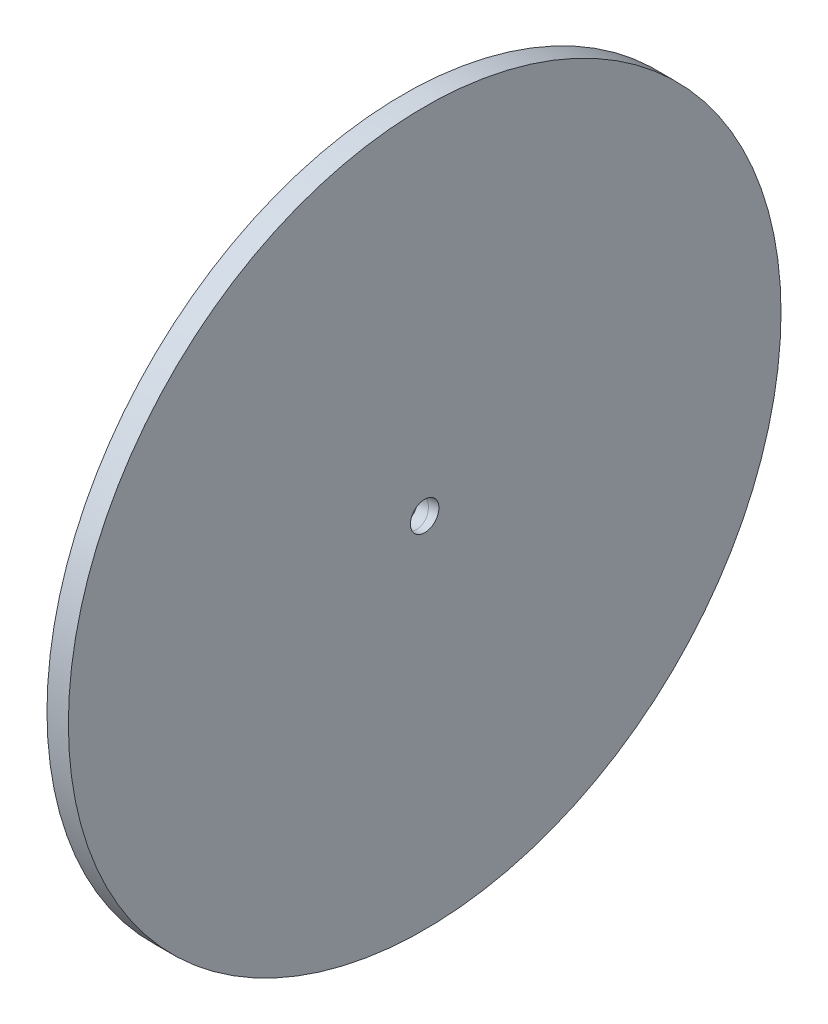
ISO-10303-21;
HEADER;
FILE_DESCRIPTION(('STEP AP214'),'2;1');
FILE_NAME('part.step','',(''),(''),'','','');
FILE_SCHEMA(('AUTOMOTIVE_DESIGN { 1 0 10303 214 1 1 1 1 }'));
ENDSEC;
DATA;
#1=APPLICATION_CONTEXT('core data for automotive mechanical design processes');
#2=APPLICATION_PROTOCOL_DEFINITION('international standard','automotive_design',2000,#1);
#3=PRODUCT_CONTEXT('',#1,'mechanical');
#4=PRODUCT('Part','Part','',(#3));
#5=PRODUCT_RELATED_PRODUCT_CATEGORY('part','',(#4));
#6=PRODUCT_DEFINITION_FORMATION('','',#4);
#7=PRODUCT_DEFINITION_CONTEXT('part definition',#1,'design');
#8=PRODUCT_DEFINITION('design','',#6,#7);
#9=PRODUCT_DEFINITION_SHAPE('','',#8);
#10=(LENGTH_UNIT() NAMED_UNIT(*) SI_UNIT(.MILLI.,.METRE.));
#11=(NAMED_UNIT(*) PLANE_ANGLE_UNIT() SI_UNIT($,.RADIAN.));
#12=(NAMED_UNIT(*) SI_UNIT($,.STERADIAN.) SOLID_ANGLE_UNIT());
#13=UNCERTAINTY_MEASURE_WITH_UNIT(LENGTH_MEASURE(1.E-05),#10,'distance_accuracy_value','');
#14=(GEOMETRIC_REPRESENTATION_CONTEXT(3) GLOBAL_UNCERTAINTY_ASSIGNED_CONTEXT((#13)) GLOBAL_UNIT_ASSIGNED_CONTEXT((#10,
#11,#12)) REPRESENTATION_CONTEXT('',''));
#15=CARTESIAN_POINT('',(0.,0.,0.));
#16=DIRECTION('',(0.,0.,1.));
#17=DIRECTION('',(1.,0.,0.));
#18=AXIS2_PLACEMENT_3D('',#15,#16,#17);
#19=CARTESIAN_POINT('',(3.,0.,0.));
#20=DIRECTION('',(-1.,0.,0.));
#21=DIRECTION('',(0.,0.,1.));
#22=AXIS2_PLACEMENT_3D('',#19,#20,#21);
#23=CYLINDRICAL_SURFACE('',#22,50.);
#24=CARTESIAN_POINT('',(3.,0.,0.));
#25=DIRECTION('',(1.,0.,0.));
#26=DIRECTION('',(0.,0.,-1.));
#27=AXIS2_PLACEMENT_3D('',#24,#25,#26);
#28=CIRCLE('',#27,50.);
#29=CARTESIAN_POINT('',(3.,0.,-50.));
#30=VERTEX_POINT('',#29);
#31=EDGE_CURVE('E11',#30,#30,#28,.T.);
#32=ORIENTED_EDGE('',*,*,#31,.F.);
#33=EDGE_LOOP('',(#32));
#34=FACE_BOUND('',#33,.T.);
#35=CARTESIAN_POINT('',(0.,0.,0.));
#36=DIRECTION('',(1.,0.,0.));
#37=DIRECTION('',(0.,0.,-1.));
#38=AXIS2_PLACEMENT_3D('',#35,#36,#37);
#39=CIRCLE('',#38,50.);
#40=CARTESIAN_POINT('',(0.,0.,-50.));
#41=VERTEX_POINT('',#40);
#42=EDGE_CURVE('E63',#41,#41,#39,.T.);
#43=ORIENTED_EDGE('',*,*,#42,.T.);
#44=EDGE_LOOP('',(#43));
#45=FACE_BOUND('',#44,.T.);
#46=ADVANCED_FACE('F55',(#34,#45),#23,.T.);
#47=CARTESIAN_POINT('',(3.,0.,0.));
#48=DIRECTION('',(1.,0.,0.));
#49=DIRECTION('',(0.,0.,-1.));
#50=AXIS2_PLACEMENT_3D('',#47,#48,#49);
#51=PLANE('',#50);
#52=CARTESIAN_POINT('',(3.,0.264490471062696,0.));
#53=DIRECTION('',(1.,0.,0.));
#54=DIRECTION('',(0.,-1.,0.));
#55=AXIS2_PLACEMENT_3D('',#52,#53,#54);
#56=ELLIPSE('',#55,2.03085322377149,2.);
#57=CARTESIAN_POINT('',(3.,-1.76636275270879,0.));
#58=VERTEX_POINT('',#57);
#59=EDGE_CURVE('E58',#58,#58,#56,.F.);
#60=ORIENTED_EDGE('',*,*,#59,.T.);
#61=EDGE_LOOP('',(#60));
#62=FACE_BOUND('',#61,.T.);
#63=ORIENTED_EDGE('',*,*,#31,.T.);
#64=EDGE_LOOP('',(#63));
#65=FACE_BOUND('',#64,.T.);
#66=ADVANCED_FACE('F96',(#62,#65),#51,.T.);
#67=CARTESIAN_POINT('',(0.,0.,0.));
#68=DIRECTION('',(1.,0.,0.));
#69=DIRECTION('',(0.,0.,-1.));
#70=AXIS2_PLACEMENT_3D('',#67,#68,#69);
#71=PLANE('',#70);
#72=CARTESIAN_POINT('',(0.,-0.264490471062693,0.));
#73=DIRECTION('',(1.,0.,0.));
#74=DIRECTION('',(0.,-1.,0.));
#75=AXIS2_PLACEMENT_3D('',#72,#73,#74);
#76=ELLIPSE('',#75,2.03085322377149,2.);
#77=CARTESIAN_POINT('',(0.,-2.29534369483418,0.));
#78=VERTEX_POINT('',#77);
#79=EDGE_CURVE('E72',#78,#78,#76,.F.);
#80=ORIENTED_EDGE('',*,*,#79,.F.);
#81=EDGE_LOOP('',(#80));
#82=FACE_BOUND('',#81,.T.);
#83=ORIENTED_EDGE('',*,*,#42,.F.);
#84=EDGE_LOOP('',(#83));
#85=FACE_BOUND('',#84,.T.);
#86=ADVANCED_FACE('F92',(#82,#85),#71,.F.);
#87=CARTESIAN_POINT('',(1.5,0.,0.));
#88=DIRECTION('',(-0.984807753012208,-0.173648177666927,0.));
#89=DIRECTION('',(0.173648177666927,-0.984807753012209,0.));
#90=AXIS2_PLACEMENT_3D('',#87,#88,#89);
#91=CYLINDRICAL_SURFACE('',#90,2.);
#92=CARTESIAN_POINT('',(1.5,0.,0.));
#93=DIRECTION('',(0.984807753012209,0.173648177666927,0.));
#94=DIRECTION('',(-0.173648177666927,0.984807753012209,0.));
#95=AXIS2_PLACEMENT_3D('',#92,#93,#94);
#96=CIRCLE('',#95,2.);
#97=CARTESIAN_POINT('',(1.15270364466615,1.96961550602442,0.));
#98=VERTEX_POINT('',#97);
#99=EDGE_CURVE('E71',#98,#98,#96,.T.);
#100=ORIENTED_EDGE('',*,*,#99,.T.);
#101=EDGE_LOOP('',(#100));
#102=FACE_BOUND('',#101,.T.);
#103=ORIENTED_EDGE('',*,*,#79,.T.);
#104=EDGE_LOOP('',(#103));
#105=FACE_BOUND('',#104,.T.);
#106=ADVANCED_FACE('F83',(#102,#105),#91,.F.);
#107=CARTESIAN_POINT('',(29.4430620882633,4.92711576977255,0.));
#108=DIRECTION('',(-0.984807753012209,-0.173648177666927,0.));
#109=DIRECTION('',(0.173648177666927,-0.984807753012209,0.));
#110=AXIS2_PLACEMENT_3D('',#107,#108,#109);
#111=CYLINDRICAL_SURFACE('',#110,2.);
#112=ORIENTED_EDGE('',*,*,#59,.F.);
#113=EDGE_LOOP('',(#112));
#114=FACE_BOUND('',#113,.T.);
#115=ORIENTED_EDGE('',*,*,#99,.F.);
#116=EDGE_LOOP('',(#115));
#117=FACE_BOUND('',#116,.T.);
#118=ADVANCED_FACE('F85',(#114,#117),#111,.F.);
#119=CLOSED_SHELL('',(#46,#66,#86,#106,#118));
#120=MANIFOLD_SOLID_BREP('B2',#119);
#121=ADVANCED_BREP_SHAPE_REPRESENTATION('',(#18,#120),#14);
#122=SHAPE_DEFINITION_REPRESENTATION(#9,#121);
ENDSEC;
END-ISO-10303-21;
